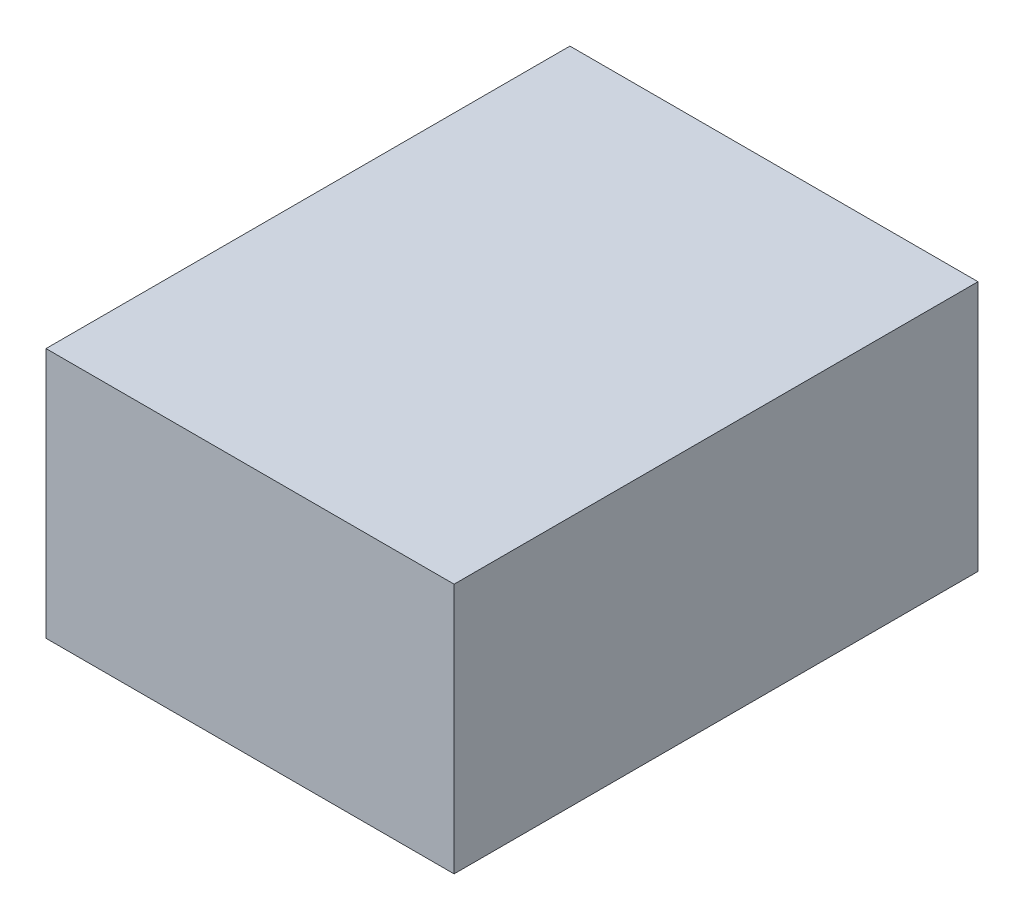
from build123d import *

# Parameters (mm, degrees)
SKETCH2_W      = 76.2
SKETCH2_H      = 97.825637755
EXTRUDE1_DEPTH = 46.853616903


with BuildPart() as part:
    # Sketch2 → Extrude1 (new body)
    with BuildSketch(Plane(origin=(0, 0, 0), x_dir=(1, 0, 0), z_dir=(0, 1, 0))):
        with Locations((38.1, -48.912818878)):
            Rectangle(SKETCH2_W, SKETCH2_H)
    extrude(amount=EXTRUDE1_DEPTH)


solid = part.part
